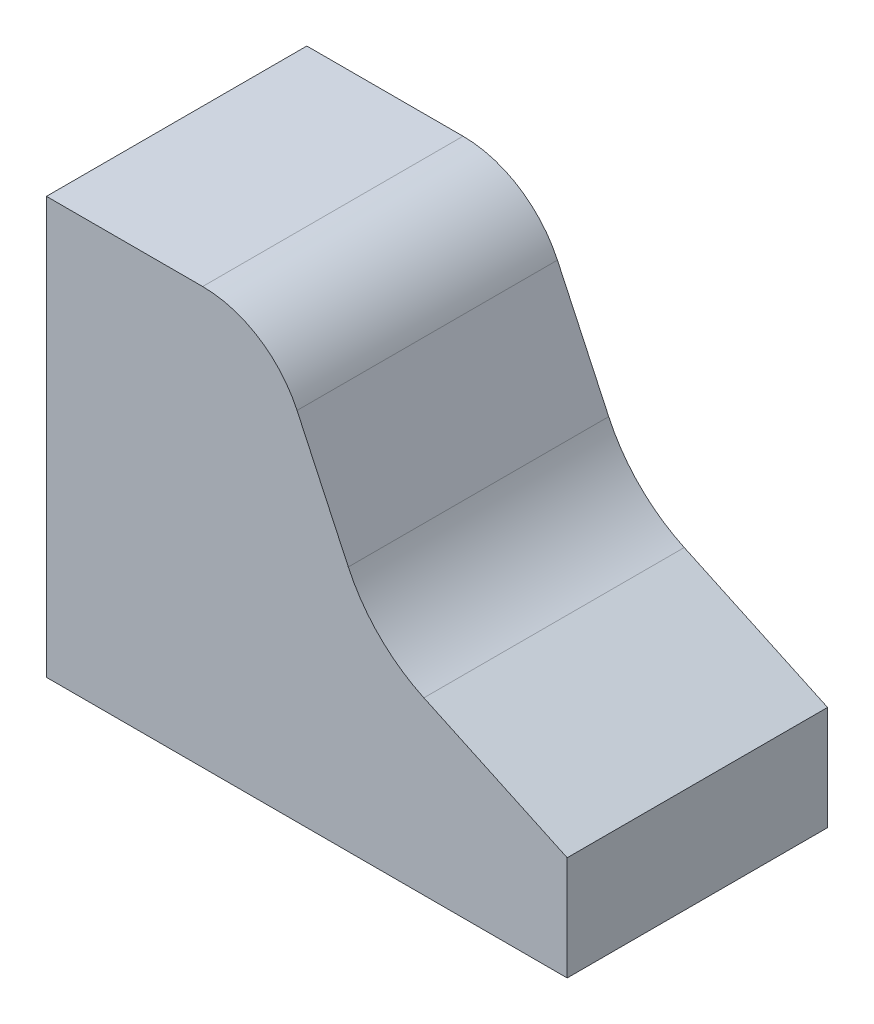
from build123d import *

# Parameters (mm, degrees)
BOSS_EXTRUDE1_DEPTH = 63.5


with BuildPart() as part:
    # Sketch1 → Boss-Extrude1 (new body)
    with BuildSketch(Plane.XY):
        with BuildLine():
            Line((0, 0), (0, 101.6))
            Line((0, 101.6), (38.1, 101.6))
            ThreePointArc((38.1, 101.6), (51.747410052, 97.622142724), (61.120217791, 86.934503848))
            Line((61.120217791, 86.934503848), (73.621158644, 60.126149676))
            ThreePointArc((73.621158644, 60.126149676), (81.210716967, 49.287137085), (92.049729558, 41.697578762))
            Line((92.049729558, 41.697578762), (127, 25.4))
            Line((127, 25.4), (127, 0))
            Line((127, 0), (0, 0))
        make_face()
    extrude(amount=BOSS_EXTRUDE1_DEPTH)


solid = part.part
